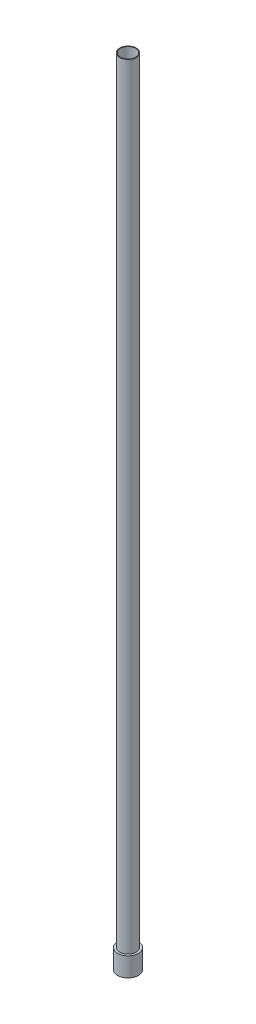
ISO-10303-21;
HEADER;
FILE_DESCRIPTION(('STEP AP214'),'2;1');
FILE_NAME('part.step','',(''),(''),'','','');
FILE_SCHEMA(('AUTOMOTIVE_DESIGN { 1 0 10303 214 1 1 1 1 }'));
ENDSEC;
DATA;
#1=APPLICATION_CONTEXT('core data for automotive mechanical design processes');
#2=APPLICATION_PROTOCOL_DEFINITION('international standard','automotive_design',2000,#1);
#3=PRODUCT_CONTEXT('',#1,'mechanical');
#4=PRODUCT('Part','Part','',(#3));
#5=PRODUCT_RELATED_PRODUCT_CATEGORY('part','',(#4));
#6=PRODUCT_DEFINITION_FORMATION('','',#4);
#7=PRODUCT_DEFINITION_CONTEXT('part definition',#1,'design');
#8=PRODUCT_DEFINITION('design','',#6,#7);
#9=PRODUCT_DEFINITION_SHAPE('','',#8);
#10=(LENGTH_UNIT() NAMED_UNIT(*) SI_UNIT(.MILLI.,.METRE.));
#11=(NAMED_UNIT(*) PLANE_ANGLE_UNIT() SI_UNIT($,.RADIAN.));
#12=(NAMED_UNIT(*) SI_UNIT($,.STERADIAN.) SOLID_ANGLE_UNIT());
#13=UNCERTAINTY_MEASURE_WITH_UNIT(LENGTH_MEASURE(1.E-05),#10,'distance_accuracy_value','');
#14=(GEOMETRIC_REPRESENTATION_CONTEXT(3) GLOBAL_UNCERTAINTY_ASSIGNED_CONTEXT((#13)) GLOBAL_UNIT_ASSIGNED_CONTEXT((#10,
#11,#12)) REPRESENTATION_CONTEXT('',''));
#15=CARTESIAN_POINT('',(0.,0.,0.));
#16=DIRECTION('',(0.,0.,1.));
#17=DIRECTION('',(1.,0.,0.));
#18=AXIS2_PLACEMENT_3D('',#15,#16,#17);
#19=CARTESIAN_POINT('',(0.,0.,0.));
#20=DIRECTION('',(0.,-1.,0.));
#21=DIRECTION('',(0.,0.,-1.));
#22=AXIS2_PLACEMENT_3D('',#19,#20,#21);
#23=CYLINDRICAL_SURFACE('',#22,2.921);
#24=CARTESIAN_POINT('',(0.,304.8,0.));
#25=DIRECTION('',(0.,-1.,0.));
#26=DIRECTION('',(0.,0.,-1.));
#27=AXIS2_PLACEMENT_3D('',#24,#25,#26);
#28=CIRCLE('',#27,2.921);
#29=CARTESIAN_POINT('',(0.,304.8,-2.921));
#30=VERTEX_POINT('',#29);
#31=EDGE_CURVE('E52',#30,#30,#28,.T.);
#32=ORIENTED_EDGE('',*,*,#31,.F.);
#33=EDGE_LOOP('',(#32));
#34=FACE_BOUND('',#33,.T.);
#35=CARTESIAN_POINT('',(0.,0.,0.));
#36=DIRECTION('',(0.,-1.,0.));
#37=DIRECTION('',(0.,0.,-1.));
#38=AXIS2_PLACEMENT_3D('',#35,#36,#37);
#39=CIRCLE('',#38,2.921);
#40=CARTESIAN_POINT('',(0.,0.,-2.921));
#41=VERTEX_POINT('',#40);
#42=EDGE_CURVE('E10',#41,#41,#39,.T.);
#43=ORIENTED_EDGE('',*,*,#42,.T.);
#44=EDGE_LOOP('',(#43));
#45=FACE_BOUND('',#44,.T.);
#46=ADVANCED_FACE('F30',(#34,#45),#23,.F.);
#47=CARTESIAN_POINT('',(-2.921,0.,0.));
#48=DIRECTION('',(0.,1.,0.));
#49=DIRECTION('',(0.,0.,1.));
#50=AXIS2_PLACEMENT_3D('',#47,#48,#49);
#51=PLANE('',#50);
#52=ORIENTED_EDGE('',*,*,#42,.F.);
#53=EDGE_LOOP('',(#52));
#54=FACE_BOUND('',#53,.T.);
#55=CARTESIAN_POINT('',(0.,0.,0.));
#56=DIRECTION('',(0.,-1.,0.));
#57=DIRECTION('',(0.,0.,-1.));
#58=AXIS2_PLACEMENT_3D('',#55,#56,#57);
#59=CIRCLE('',#58,3.9624);
#60=CARTESIAN_POINT('',(0.,0.,-3.9624));
#61=VERTEX_POINT('',#60);
#62=EDGE_CURVE('E36',#61,#61,#59,.T.);
#63=ORIENTED_EDGE('',*,*,#62,.T.);
#64=EDGE_LOOP('',(#63));
#65=FACE_BOUND('',#64,.T.);
#66=ADVANCED_FACE('F59',(#54,#65),#51,.F.);
#67=CARTESIAN_POINT('',(0.,0.,0.));
#68=DIRECTION('',(0.,-1.,0.));
#69=DIRECTION('',(0.,0.,-1.));
#70=AXIS2_PLACEMENT_3D('',#67,#68,#69);
#71=CYLINDRICAL_SURFACE('',#70,3.9624);
#72=ORIENTED_EDGE('',*,*,#62,.F.);
#73=EDGE_LOOP('',(#72));
#74=FACE_BOUND('',#73,.T.);
#75=CARTESIAN_POINT('',(0.,7.366,0.));
#76=DIRECTION('',(0.,-1.,0.));
#77=DIRECTION('',(0.,0.,-1.));
#78=AXIS2_PLACEMENT_3D('',#75,#76,#77);
#79=CIRCLE('',#78,3.9624);
#80=CARTESIAN_POINT('',(0.,7.366,-3.9624));
#81=VERTEX_POINT('',#80);
#82=EDGE_CURVE('E40',#81,#81,#79,.T.);
#83=ORIENTED_EDGE('',*,*,#82,.T.);
#84=EDGE_LOOP('',(#83));
#85=FACE_BOUND('',#84,.T.);
#86=ADVANCED_FACE('F63',(#74,#85),#71,.T.);
#87=CARTESIAN_POINT('',(-3.9624,7.366,0.));
#88=DIRECTION('',(0.,-1.,0.));
#89=DIRECTION('',(0.,0.,-1.));
#90=AXIS2_PLACEMENT_3D('',#87,#88,#89);
#91=PLANE('',#90);
#92=ORIENTED_EDGE('',*,*,#82,.F.);
#93=EDGE_LOOP('',(#92));
#94=FACE_BOUND('',#93,.T.);
#95=CARTESIAN_POINT('',(0.,7.366,0.));
#96=DIRECTION('',(0.,-1.,0.));
#97=DIRECTION('',(0.,0.,-1.));
#98=AXIS2_PLACEMENT_3D('',#95,#96,#97);
#99=CIRCLE('',#98,3.175);
#100=CARTESIAN_POINT('',(0.,7.366,-3.175));
#101=VERTEX_POINT('',#100);
#102=EDGE_CURVE('E44',#101,#101,#99,.T.);
#103=ORIENTED_EDGE('',*,*,#102,.T.);
#104=EDGE_LOOP('',(#103));
#105=FACE_BOUND('',#104,.T.);
#106=ADVANCED_FACE('F68',(#94,#105),#91,.F.);
#107=CARTESIAN_POINT('',(0.,0.,0.));
#108=DIRECTION('',(0.,-1.,0.));
#109=DIRECTION('',(0.,0.,-1.));
#110=AXIS2_PLACEMENT_3D('',#107,#108,#109);
#111=CYLINDRICAL_SURFACE('',#110,3.175);
#112=ORIENTED_EDGE('',*,*,#102,.F.);
#113=EDGE_LOOP('',(#112));
#114=FACE_BOUND('',#113,.T.);
#115=CARTESIAN_POINT('',(0.,304.8,0.));
#116=DIRECTION('',(0.,-1.,0.));
#117=DIRECTION('',(0.,0.,-1.));
#118=AXIS2_PLACEMENT_3D('',#115,#116,#117);
#119=CIRCLE('',#118,3.175);
#120=CARTESIAN_POINT('',(0.,304.8,-3.175));
#121=VERTEX_POINT('',#120);
#122=EDGE_CURVE('E49',#121,#121,#119,.T.);
#123=ORIENTED_EDGE('',*,*,#122,.T.);
#124=EDGE_LOOP('',(#123));
#125=FACE_BOUND('',#124,.T.);
#126=ADVANCED_FACE('F74',(#114,#125),#111,.T.);
#127=CARTESIAN_POINT('',(-3.175,304.8,0.));
#128=DIRECTION('',(0.,-1.,0.));
#129=DIRECTION('',(0.,0.,-1.));
#130=AXIS2_PLACEMENT_3D('',#127,#128,#129);
#131=PLANE('',#130);
#132=ORIENTED_EDGE('',*,*,#122,.F.);
#133=EDGE_LOOP('',(#132));
#134=FACE_BOUND('',#133,.T.);
#135=ORIENTED_EDGE('',*,*,#31,.T.);
#136=EDGE_LOOP('',(#135));
#137=FACE_BOUND('',#136,.T.);
#138=ADVANCED_FACE('F56',(#134,#137),#131,.F.);
#139=CLOSED_SHELL('',(#46,#66,#86,#106,#126,#138));
#140=MANIFOLD_SOLID_BREP('B2',#139);
#141=ADVANCED_BREP_SHAPE_REPRESENTATION('',(#18,#140),#14);
#142=SHAPE_DEFINITION_REPRESENTATION(#9,#141);
ENDSEC;
END-ISO-10303-21;
